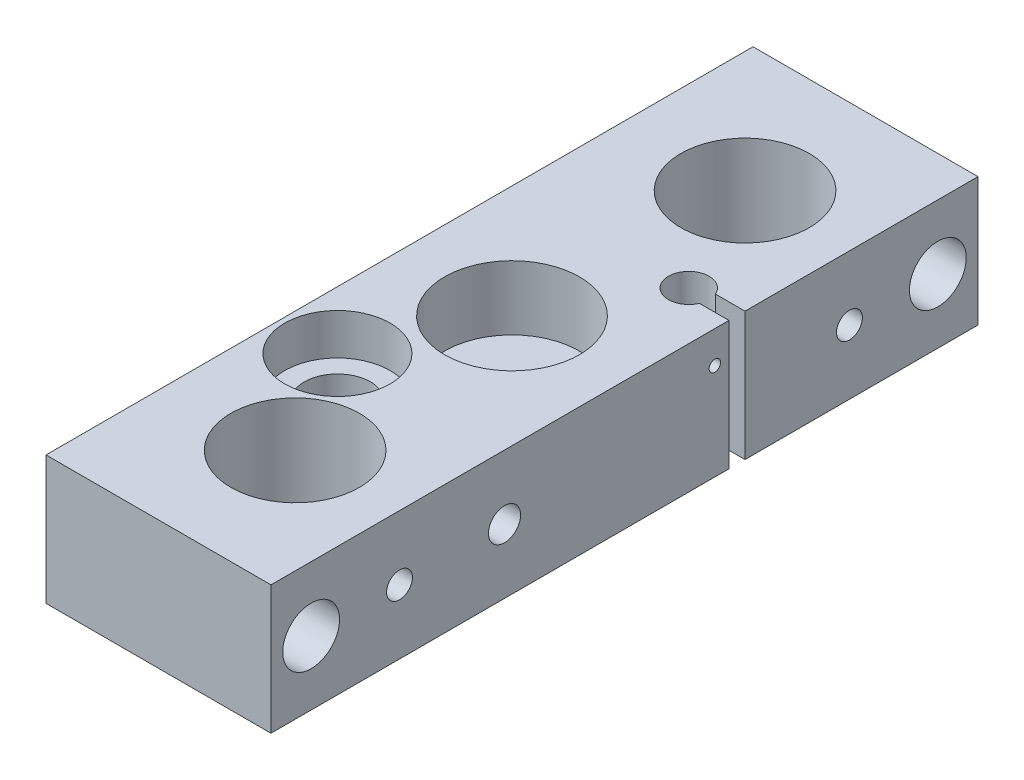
from build123d import *

# Parameters (mm, degrees)
SKETCH1_W                                      = 44.45
SKETCH1_H                                      = 139.7
EXTRUDE1_DEPTH                                 = 12.7
SKETCH2_R                                      = 12.7
CUT_EXTRUDE1_DEPTH                             = 78.57662744
F_1_4_20_MOUNTING_HOLES_REACH                  = 85.762
F_1_4_20_MOUNTING_HOLES_BORE_R                 = 2.5527
CBORE_FOR_5_16_SHCS_MOUNTING_HOLES_D           = 8.4328
CBORE_FOR_5_16_SHCS_MOUNTING_HOLES_CBORE_D     = 11.2268
CBORE_FOR_5_16_SHCS_MOUNTING_HOLES_CBORE_DEPTH = 7.9375
SKETCH7_R                                      = 10.414
CUT_EXTRUDE2_DEPTH                             = 8.128
F_1_2_20_SHOCK_MOUNT_D                         = 13.09624
SKETCH10_R                                     = 13.335
CUT_EXTRUDE3_DEPTH                             = 12.7
F_4_40_TAPPED_HOLE1_D                          = 2.2606
F_4_40_TAPPED_HOLE1_DEPTH                      = 12.827
F_4_40_TAPPED_HOLE1_TIP                        = 0.679152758
CUT_EXTRUDE4_SENSOR_MOUNT_DEPTH                = 78.576627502
SKETCH18_R                                     = 3.175
CUT_EXTRUDE4_DEPTH                             = 15.875
F_10_32_TAPPED_HOLE1_REACH                     = 78.53
F_10_32_TAPPED_HOLE1_BORE_R                    = 2.0193


with BuildPart() as part:
    # Sketch1 → Extrude1 (new, symmetric)
    with BuildSketch(Plane(origin=(0, 0, 0), x_dir=(1, 0, 0), z_dir=(0, 1, 0))):
        Rectangle(SKETCH1_W, SKETCH1_H)
    extrude(amount=EXTRUDE1_DEPTH, both=True)

    # Sketch2 → Cut-Extrude1 (cut, through all)
    with BuildSketch(Plane(origin=(0, 12.7, 0), x_dir=(-1, 0, 0), z_dir=(0, 1, 0))):
        with Locations(Location((-1.6002, 44.45, 0), (0, 0, 90))):
            Circle(SKETCH2_R)
        with Locations(Location((-1.6002, -44.45, 0), (0, 0, 270))):
            Circle(SKETCH2_R)
    extrude(amount=-CUT_EXTRUDE1_DEPTH, mode=Mode.SUBTRACT)

    # 1_4-20 _Mounting Holes bore → 1_4-20 _Mounting Holes (cut, up to next)
    with BuildSketch(Plane(origin=(22.225, 0, 0), x_dir=(0, 0, -1), z_dir=(1, 0, 0)), mode=Mode.PRIVATE) as f_1_4_20_mounting_holes_sk1:
        with Locations((-44.45, 0)):
            Circle(F_1_4_20_MOUNTING_HOLES_BORE_R)
    f_1_4_20_mounting_holes_tool1 = extrude(f_1_4_20_mounting_holes_sk1.sketch, amount=-F_1_4_20_MOUNTING_HOLES_REACH, mode=Mode.PRIVATE) & part.part
    # 1_4-20 _Mounting Holes bore → 1_4-20 _Mounting Holes (cut, up to next)
    with BuildSketch(Plane(origin=(22.225, 0, 0), x_dir=(0, 0, -1), z_dir=(1, 0, 0)), mode=Mode.PRIVATE) as f_1_4_20_mounting_holes_sk2:
        with Locations((44.45, 0)):
            Circle(F_1_4_20_MOUNTING_HOLES_BORE_R)
    f_1_4_20_mounting_holes_tool2 = extrude(f_1_4_20_mounting_holes_sk2.sketch, amount=-F_1_4_20_MOUNTING_HOLES_REACH, mode=Mode.PRIVATE) & part.part
    add(f_1_4_20_mounting_holes_tool1.solids().sort_by_distance((22.225, 0, 44.45))[0], mode=Mode.SUBTRACT)
    add(f_1_4_20_mounting_holes_tool2.solids().sort_by_distance((22.225, 0, -44.45))[0], mode=Mode.SUBTRACT)

    # CBORE for 5_16 Shcs _Mounting Holes (through all)
    with Locations(Plane(origin=(22.225, 0, 0), x_dir=(0, 0, -1), z_dir=(1, 0, 0))):
        with Locations((61.9125, 0), (-61.9125, 0)):
            CounterBoreHole(CBORE_FOR_5_16_SHCS_MOUNTING_HOLES_D / 2, CBORE_FOR_5_16_SHCS_MOUNTING_HOLES_CBORE_D / 2, CBORE_FOR_5_16_SHCS_MOUNTING_HOLES_CBORE_DEPTH)

    # Sketch7 → Cut-Extrude2 (cut)
    with BuildSketch(Plane(origin=(0, 12.7, 0), x_dir=(-1, 0, 0), z_dir=(0, 1, 0))):
        with Locations(Location((10.795, 23.6982, 0), (0, 0, 90))):
            Circle(SKETCH7_R)
    extrude(amount=-CUT_EXTRUDE2_DEPTH, mode=Mode.SUBTRACT)

    # 1_2-20 _Shock Mount (through all)
    with Locations(Plane(origin=(0, 4.572, 0), x_dir=(-1, 0, 0), z_dir=(0, 1, 0))):
        with Locations((10.795, 23.6982)):
            Hole(F_1_2_20_SHOCK_MOUNT_D / 2)

    # Sketch10 → Cut-Extrude3 (cut)
    with BuildSketch(Plane(origin=(0, 12.7, 0), x_dir=(-1, 0, 0), z_dir=(0, 1, 0))):
        with Locations(Location((0, 0, 0), (0, 0, 90))):
            Circle(SKETCH10_R)
    extrude(amount=-CUT_EXTRUDE3_DEPTH, mode=Mode.SUBTRACT)

    # Sketch13 → 1_8 NPT _Air Port (revolve, cut)
    with BuildSketch(Plane(origin=(0, -12.7, 0), x_dir=(0, 0, -1), z_dir=(1, 0, 0))):
        Polygon((0, 0), (0, 25.4), (4.2164, 25.4), (4.2164, 6.92404), (4.53740497, 6.92404), (4.74472, 0), align=None)
    revolve(axis=Axis((0, -19.05, 0), (0, 1, 0)), mode=Mode.SUBTRACT)

    # 4-40 Tapped Hole1
    with Locations(Plane(origin=(22.225, 0, 0), x_dir=(0, 0, -1), z_dir=(1, 0, 0))):
        with Locations((17.8562, 6.35)):
            Hole(F_4_40_TAPPED_HOLE1_D / 2, depth=F_4_40_TAPPED_HOLE1_DEPTH)
            with Locations((0, 0, -(F_4_40_TAPPED_HOLE1_DEPTH + F_4_40_TAPPED_HOLE1_TIP / 2))):  # 118° drill point
                Cone(0, F_4_40_TAPPED_HOLE1_D / 2, F_4_40_TAPPED_HOLE1_TIP, mode=Mode.SUBTRACT)

    # Sketch17 → Cut-Extrude4 _Sensor Mount (cut, through all)
    with BuildSketch(Plane(origin=(0, 12.7, 0), x_dir=(-1, 0, 0), z_dir=(0, 1, 0))):
        with BuildLine():
            Line((-22.225, -23.8125), (-16.385867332, -23.8125))
            ThreePointArc((-16.385867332, -23.8125), (-8.6868, -22.225), (-16.385867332, -20.6375))
            Line((-16.385867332, -20.6375), (-22.225, -20.6375))
            Line((-22.225, -20.6375), (-22.225, -23.8125))
        make_face()
    extrude(amount=-CUT_EXTRUDE4_SENSOR_MOUNT_DEPTH, mode=Mode.SUBTRACT)

    # Sketch18 → Cut-Extrude4 (cut)
    with BuildSketch(Plane(origin=(22.225, 0, 0), x_dir=(0, 0, -1), z_dir=(1, 0, 0))):
        with Locations((-23.6982, 0)):
            Circle(SKETCH18_R)
    extrude(amount=-CUT_EXTRUDE4_DEPTH, mode=Mode.SUBTRACT)

    # 10-32 Tapped Hole1 bore → 10-32 Tapped Hole1 (cut, up to next)
    with BuildSketch(Plane(origin=(6.35, 0, 0), x_dir=(0, 0, -1), z_dir=(1, 0, 0)), mode=Mode.PRIVATE) as f_10_32_tapped_hole1_sk1:
        with Locations((-23.6982, 0)):
            Circle(F_10_32_TAPPED_HOLE1_BORE_R)
    f_10_32_tapped_hole1_tool1 = extrude(f_10_32_tapped_hole1_sk1.sketch, amount=-F_10_32_TAPPED_HOLE1_REACH, mode=Mode.PRIVATE) & part.part
    add(f_10_32_tapped_hole1_tool1.solids().sort_by_distance((6.35, 0, 23.6982))[0], mode=Mode.SUBTRACT)


solid = part.part
